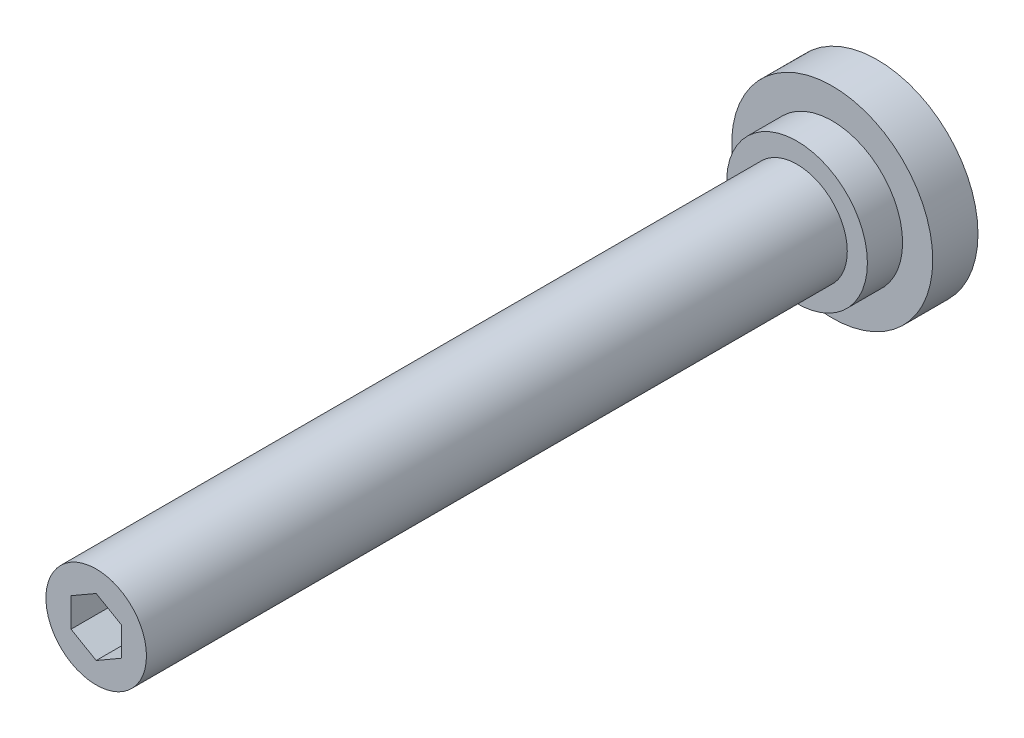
ISO-10303-21;
HEADER;
FILE_DESCRIPTION(('STEP AP214'),'2;1');
FILE_NAME('part.step','',(''),(''),'','','');
FILE_SCHEMA(('AUTOMOTIVE_DESIGN { 1 0 10303 214 1 1 1 1 }'));
ENDSEC;
DATA;
#1=APPLICATION_CONTEXT('core data for automotive mechanical design processes');
#2=APPLICATION_PROTOCOL_DEFINITION('international standard','automotive_design',2000,#1);
#3=PRODUCT_CONTEXT('',#1,'mechanical');
#4=PRODUCT('Part','Part','',(#3));
#5=PRODUCT_RELATED_PRODUCT_CATEGORY('part','',(#4));
#6=PRODUCT_DEFINITION_FORMATION('','',#4);
#7=PRODUCT_DEFINITION_CONTEXT('part definition',#1,'design');
#8=PRODUCT_DEFINITION('design','',#6,#7);
#9=PRODUCT_DEFINITION_SHAPE('','',#8);
#10=(LENGTH_UNIT() NAMED_UNIT(*) SI_UNIT(.MILLI.,.METRE.));
#11=(NAMED_UNIT(*) PLANE_ANGLE_UNIT() SI_UNIT($,.RADIAN.));
#12=(NAMED_UNIT(*) SI_UNIT($,.STERADIAN.) SOLID_ANGLE_UNIT());
#13=UNCERTAINTY_MEASURE_WITH_UNIT(LENGTH_MEASURE(1.E-05),#10,'distance_accuracy_value','');
#14=(GEOMETRIC_REPRESENTATION_CONTEXT(3) GLOBAL_UNCERTAINTY_ASSIGNED_CONTEXT((#13)) GLOBAL_UNIT_ASSIGNED_CONTEXT((#10,
#11,#12)) REPRESENTATION_CONTEXT('',''));
#15=CARTESIAN_POINT('',(0.,0.,0.));
#16=DIRECTION('',(0.,0.,1.));
#17=DIRECTION('',(1.,0.,0.));
#18=AXIS2_PLACEMENT_3D('',#15,#16,#17);
#19=CARTESIAN_POINT('',(0.,0.,155.4));
#20=DIRECTION('',(0.,0.,1.));
#21=DIRECTION('',(1.,0.,0.));
#22=AXIS2_PLACEMENT_3D('',#19,#20,#21);
#23=PLANE('',#22);
#24=DIRECTION('',(-0.866025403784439,0.5,0.));
#25=VECTOR('',#24,1.);
#26=CARTESIAN_POINT('',(5.,2.88675134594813,155.4));
#27=LINE('',#26,#25);
#28=CARTESIAN_POINT('',(5.,2.88675134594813,155.4));
#29=VERTEX_POINT('',#28);
#30=CARTESIAN_POINT('',(0.,5.77350269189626,155.4));
#31=VERTEX_POINT('',#30);
#32=EDGE_CURVE('E28',#29,#31,#27,.T.);
#33=ORIENTED_EDGE('',*,*,#32,.F.);
#34=DIRECTION('',(0.,1.,0.));
#35=VECTOR('',#34,1.);
#36=CARTESIAN_POINT('',(5.,-2.88675134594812,155.4));
#37=LINE('',#36,#35);
#38=CARTESIAN_POINT('',(5.,-2.88675134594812,155.4));
#39=VERTEX_POINT('',#38);
#40=EDGE_CURVE('E111',#39,#29,#37,.T.);
#41=ORIENTED_EDGE('',*,*,#40,.F.);
#42=DIRECTION('',(0.866025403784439,0.5,0.));
#43=VECTOR('',#42,1.);
#44=CARTESIAN_POINT('',(0.,-5.77350269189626,155.4));
#45=LINE('',#44,#43);
#46=CARTESIAN_POINT('',(0.,-5.77350269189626,155.4));
#47=VERTEX_POINT('',#46);
#48=EDGE_CURVE('E109',#47,#39,#45,.T.);
#49=ORIENTED_EDGE('',*,*,#48,.F.);
#50=DIRECTION('',(0.866025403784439,-0.5,0.));
#51=VECTOR('',#50,1.);
#52=CARTESIAN_POINT('',(-5.,-2.88675134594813,155.4));
#53=LINE('',#52,#51);
#54=CARTESIAN_POINT('',(-5.,-2.88675134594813,155.4));
#55=VERTEX_POINT('',#54);
#56=EDGE_CURVE('E76',#55,#47,#53,.T.);
#57=ORIENTED_EDGE('',*,*,#56,.F.);
#58=DIRECTION('',(0.,-1.,0.));
#59=VECTOR('',#58,1.);
#60=CARTESIAN_POINT('',(-5.,2.88675134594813,155.4));
#61=LINE('',#60,#59);
#62=CARTESIAN_POINT('',(-5.,2.88675134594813,155.4));
#63=VERTEX_POINT('',#62);
#64=EDGE_CURVE('E105',#63,#55,#61,.T.);
#65=ORIENTED_EDGE('',*,*,#64,.F.);
#66=DIRECTION('',(-0.866025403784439,-0.5,0.));
#67=VECTOR('',#66,1.);
#68=CARTESIAN_POINT('',(0.,5.77350269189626,155.4));
#69=LINE('',#68,#67);
#70=EDGE_CURVE('E102',#31,#63,#69,.T.);
#71=ORIENTED_EDGE('',*,*,#70,.F.);
#72=EDGE_LOOP('',(#33,#41,#49,#57,#65,#71));
#73=FACE_BOUND('',#72,.T.);
#74=CARTESIAN_POINT('',(0.,0.,155.4));
#75=DIRECTION('',(0.,0.,1.));
#76=DIRECTION('',(1.,0.,0.));
#77=AXIS2_PLACEMENT_3D('',#74,#75,#76);
#78=CIRCLE('',#77,10.);
#79=CARTESIAN_POINT('',(10.,0.,155.4));
#80=VERTEX_POINT('',#79);
#81=EDGE_CURVE('E9',#80,#80,#78,.T.);
#82=ORIENTED_EDGE('',*,*,#81,.T.);
#83=EDGE_LOOP('',(#82));
#84=FACE_BOUND('',#83,.T.);
#85=ADVANCED_FACE('F14',(#73,#84),#23,.T.);
#86=CARTESIAN_POINT('',(0.,0.,30.));
#87=DIRECTION('',(0.,0.,1.));
#88=DIRECTION('',(1.,0.,0.));
#89=AXIS2_PLACEMENT_3D('',#86,#87,#88);
#90=CYLINDRICAL_SURFACE('',#89,10.);
#91=CARTESIAN_POINT('',(0.,0.,16.));
#92=DIRECTION('',(0.,0.,1.));
#93=DIRECTION('',(1.,0.,0.));
#94=AXIS2_PLACEMENT_3D('',#91,#92,#93);
#95=CIRCLE('',#94,10.);
#96=CARTESIAN_POINT('',(10.,0.,16.));
#97=VERTEX_POINT('',#96);
#98=EDGE_CURVE('E21',#97,#97,#95,.T.);
#99=ORIENTED_EDGE('',*,*,#98,.T.);
#100=EDGE_LOOP('',(#99));
#101=FACE_BOUND('',#100,.T.);
#102=ORIENTED_EDGE('',*,*,#81,.F.);
#103=EDGE_LOOP('',(#102));
#104=FACE_BOUND('',#103,.T.);
#105=ADVANCED_FACE('F134',(#101,#104),#90,.T.);
#106=CARTESIAN_POINT('',(-10.,0.,16.));
#107=DIRECTION('',(0.,0.,1.));
#108=DIRECTION('',(1.,0.,0.));
#109=AXIS2_PLACEMENT_3D('',#106,#107,#108);
#110=PLANE('',#109);
#111=CARTESIAN_POINT('',(0.,0.,16.));
#112=DIRECTION('',(0.,0.,1.));
#113=DIRECTION('',(1.,0.,0.));
#114=AXIS2_PLACEMENT_3D('',#111,#112,#113);
#115=CIRCLE('',#114,14.);
#116=CARTESIAN_POINT('',(14.,0.,16.));
#117=VERTEX_POINT('',#116);
#118=EDGE_CURVE('E129',#117,#117,#115,.T.);
#119=ORIENTED_EDGE('',*,*,#118,.T.);
#120=EDGE_LOOP('',(#119));
#121=FACE_BOUND('',#120,.T.);
#122=ORIENTED_EDGE('',*,*,#98,.F.);
#123=EDGE_LOOP('',(#122));
#124=FACE_BOUND('',#123,.T.);
#125=ADVANCED_FACE('F137',(#121,#124),#110,.T.);
#126=CARTESIAN_POINT('',(0.,0.,30.));
#127=DIRECTION('',(0.,0.,1.));
#128=DIRECTION('',(1.,0.,0.));
#129=AXIS2_PLACEMENT_3D('',#126,#127,#128);
#130=CYLINDRICAL_SURFACE('',#129,14.);
#131=CARTESIAN_POINT('',(0.,0.,9.));
#132=DIRECTION('',(0.,0.,1.));
#133=DIRECTION('',(1.,0.,0.));
#134=AXIS2_PLACEMENT_3D('',#131,#132,#133);
#135=CIRCLE('',#134,14.);
#136=CARTESIAN_POINT('',(14.,0.,9.));
#137=VERTEX_POINT('',#136);
#138=EDGE_CURVE('E126',#137,#137,#135,.T.);
#139=ORIENTED_EDGE('',*,*,#138,.T.);
#140=EDGE_LOOP('',(#139));
#141=FACE_BOUND('',#140,.T.);
#142=ORIENTED_EDGE('',*,*,#118,.F.);
#143=EDGE_LOOP('',(#142));
#144=FACE_BOUND('',#143,.T.);
#145=ADVANCED_FACE('F139',(#141,#144),#130,.T.);
#146=CARTESIAN_POINT('',(-14.,0.,9.));
#147=DIRECTION('',(0.,0.,1.));
#148=DIRECTION('',(1.,0.,0.));
#149=AXIS2_PLACEMENT_3D('',#146,#147,#148);
#150=PLANE('',#149);
#151=CARTESIAN_POINT('',(0.,0.,9.));
#152=DIRECTION('',(0.,0.,1.));
#153=DIRECTION('',(1.,0.,0.));
#154=AXIS2_PLACEMENT_3D('',#151,#152,#153);
#155=CIRCLE('',#154,20.);
#156=CARTESIAN_POINT('',(20.,0.,9.));
#157=VERTEX_POINT('',#156);
#158=EDGE_CURVE('E123',#157,#157,#155,.T.);
#159=ORIENTED_EDGE('',*,*,#158,.T.);
#160=EDGE_LOOP('',(#159));
#161=FACE_BOUND('',#160,.T.);
#162=ORIENTED_EDGE('',*,*,#138,.F.);
#163=EDGE_LOOP('',(#162));
#164=FACE_BOUND('',#163,.T.);
#165=ADVANCED_FACE('F147',(#161,#164),#150,.T.);
#166=CARTESIAN_POINT('',(0.,0.,30.));
#167=DIRECTION('',(0.,0.,1.));
#168=DIRECTION('',(1.,0.,0.));
#169=AXIS2_PLACEMENT_3D('',#166,#167,#168);
#170=CYLINDRICAL_SURFACE('',#169,20.);
#171=CARTESIAN_POINT('',(0.,0.,0.));
#172=DIRECTION('',(0.,0.,1.));
#173=DIRECTION('',(1.,0.,0.));
#174=AXIS2_PLACEMENT_3D('',#171,#172,#173);
#175=CIRCLE('',#174,20.);
#176=CARTESIAN_POINT('',(20.,0.,0.));
#177=VERTEX_POINT('',#176);
#178=EDGE_CURVE('E115',#177,#177,#175,.T.);
#179=ORIENTED_EDGE('',*,*,#178,.T.);
#180=EDGE_LOOP('',(#179));
#181=FACE_BOUND('',#180,.T.);
#182=ORIENTED_EDGE('',*,*,#158,.F.);
#183=EDGE_LOOP('',(#182));
#184=FACE_BOUND('',#183,.T.);
#185=ADVANCED_FACE('F172',(#181,#184),#170,.T.);
#186=CARTESIAN_POINT('',(-20.,0.,0.));
#187=DIRECTION('',(0.,0.,-1.));
#188=DIRECTION('',(-1.,0.,0.));
#189=AXIS2_PLACEMENT_3D('',#186,#187,#188);
#190=PLANE('',#189);
#191=ORIENTED_EDGE('',*,*,#178,.F.);
#192=EDGE_LOOP('',(#191));
#193=FACE_BOUND('',#192,.T.);
#194=ADVANCED_FACE('F165',(#193),#190,.T.);
#195=CARTESIAN_POINT('',(5.,2.88675134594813,147.4));
#196=DIRECTION('',(0.5,0.866025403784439,0.));
#197=DIRECTION('',(-0.866025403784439,0.5,0.));
#198=AXIS2_PLACEMENT_3D('',#195,#196,#197);
#199=PLANE('',#198);
#200=ORIENTED_EDGE('',*,*,#32,.T.);
#201=DIRECTION('',(0.,0.,1.));
#202=VECTOR('',#201,1.);
#203=CARTESIAN_POINT('',(0.,5.77350269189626,147.4));
#204=LINE('',#203,#202);
#205=CARTESIAN_POINT('',(0.,5.77350269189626,147.4));
#206=VERTEX_POINT('',#205);
#207=EDGE_CURVE('E58',#206,#31,#204,.T.);
#208=ORIENTED_EDGE('',*,*,#207,.F.);
#209=DIRECTION('',(-0.866025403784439,0.5,0.));
#210=VECTOR('',#209,1.);
#211=CARTESIAN_POINT('',(5.,2.88675134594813,147.4));
#212=LINE('',#211,#210);
#213=CARTESIAN_POINT('',(5.,2.88675134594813,147.4));
#214=VERTEX_POINT('',#213);
#215=EDGE_CURVE('E113',#214,#206,#212,.T.);
#216=ORIENTED_EDGE('',*,*,#215,.F.);
#217=DIRECTION('',(0.,0.,1.));
#218=VECTOR('',#217,1.);
#219=CARTESIAN_POINT('',(5.,2.88675134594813,147.4));
#220=LINE('',#219,#218);
#221=EDGE_CURVE('E36',#214,#29,#220,.T.);
#222=ORIENTED_EDGE('',*,*,#221,.T.);
#223=EDGE_LOOP('',(#200,#208,#216,#222));
#224=FACE_BOUND('',#223,.T.);
#225=ADVANCED_FACE('F162',(#224),#199,.F.);
#226=CARTESIAN_POINT('',(5.,-2.88675134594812,147.4));
#227=DIRECTION('',(1.,0.,0.));
#228=DIRECTION('',(0.,1.,0.));
#229=AXIS2_PLACEMENT_3D('',#226,#227,#228);
#230=PLANE('',#229);
#231=ORIENTED_EDGE('',*,*,#40,.T.);
#232=ORIENTED_EDGE('',*,*,#221,.F.);
#233=DIRECTION('',(0.,1.,0.));
#234=VECTOR('',#233,1.);
#235=CARTESIAN_POINT('',(5.,-2.88675134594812,147.4));
#236=LINE('',#235,#234);
#237=CARTESIAN_POINT('',(5.,-2.88675134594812,147.4));
#238=VERTEX_POINT('',#237);
#239=EDGE_CURVE('E88',#238,#214,#236,.T.);
#240=ORIENTED_EDGE('',*,*,#239,.F.);
#241=DIRECTION('',(0.,0.,1.));
#242=VECTOR('',#241,1.);
#243=CARTESIAN_POINT('',(5.,-2.88675134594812,147.4));
#244=LINE('',#243,#242);
#245=EDGE_CURVE('E80',#238,#39,#244,.T.);
#246=ORIENTED_EDGE('',*,*,#245,.T.);
#247=EDGE_LOOP('',(#231,#232,#240,#246));
#248=FACE_BOUND('',#247,.T.);
#249=ADVANCED_FACE('F164',(#248),#230,.F.);
#250=CARTESIAN_POINT('',(0.,-5.77350269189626,147.4));
#251=DIRECTION('',(0.5,-0.866025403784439,0.));
#252=DIRECTION('',(0.866025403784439,0.5,0.));
#253=AXIS2_PLACEMENT_3D('',#250,#251,#252);
#254=PLANE('',#253);
#255=ORIENTED_EDGE('',*,*,#48,.T.);
#256=ORIENTED_EDGE('',*,*,#245,.F.);
#257=DIRECTION('',(0.866025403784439,0.5,0.));
#258=VECTOR('',#257,1.);
#259=CARTESIAN_POINT('',(0.,-5.77350269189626,147.4));
#260=LINE('',#259,#258);
#261=CARTESIAN_POINT('',(0.,-5.77350269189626,147.4));
#262=VERTEX_POINT('',#261);
#263=EDGE_CURVE('E84',#262,#238,#260,.T.);
#264=ORIENTED_EDGE('',*,*,#263,.F.);
#265=DIRECTION('',(0.,0.,1.));
#266=VECTOR('',#265,1.);
#267=CARTESIAN_POINT('',(0.,-5.77350269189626,147.4));
#268=LINE('',#267,#266);
#269=EDGE_CURVE('E69',#262,#47,#268,.T.);
#270=ORIENTED_EDGE('',*,*,#269,.T.);
#271=EDGE_LOOP('',(#255,#256,#264,#270));
#272=FACE_BOUND('',#271,.T.);
#273=ADVANCED_FACE('F85',(#272),#254,.F.);
#274=CARTESIAN_POINT('',(-5.,-2.88675134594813,147.4));
#275=DIRECTION('',(-0.5,-0.866025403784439,0.));
#276=DIRECTION('',(0.866025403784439,-0.5,0.));
#277=AXIS2_PLACEMENT_3D('',#274,#275,#276);
#278=PLANE('',#277);
#279=ORIENTED_EDGE('',*,*,#56,.T.);
#280=ORIENTED_EDGE('',*,*,#269,.F.);
#281=DIRECTION('',(0.866025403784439,-0.5,0.));
#282=VECTOR('',#281,1.);
#283=CARTESIAN_POINT('',(-5.,-2.88675134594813,147.4));
#284=LINE('',#283,#282);
#285=CARTESIAN_POINT('',(-5.,-2.88675134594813,147.4));
#286=VERTEX_POINT('',#285);
#287=EDGE_CURVE('E73',#286,#262,#284,.T.);
#288=ORIENTED_EDGE('',*,*,#287,.F.);
#289=DIRECTION('',(0.,0.,1.));
#290=VECTOR('',#289,1.);
#291=CARTESIAN_POINT('',(-5.,-2.88675134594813,147.4));
#292=LINE('',#291,#290);
#293=EDGE_CURVE('E81',#286,#55,#292,.T.);
#294=ORIENTED_EDGE('',*,*,#293,.T.);
#295=EDGE_LOOP('',(#279,#280,#288,#294));
#296=FACE_BOUND('',#295,.T.);
#297=ADVANCED_FACE('F71',(#296),#278,.F.);
#298=CARTESIAN_POINT('',(-5.,2.88675134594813,147.4));
#299=DIRECTION('',(-1.,0.,0.));
#300=DIRECTION('',(0.,-1.,0.));
#301=AXIS2_PLACEMENT_3D('',#298,#299,#300);
#302=PLANE('',#301);
#303=ORIENTED_EDGE('',*,*,#64,.T.);
#304=ORIENTED_EDGE('',*,*,#293,.F.);
#305=DIRECTION('',(0.,-1.,0.));
#306=VECTOR('',#305,1.);
#307=CARTESIAN_POINT('',(-5.,2.88675134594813,147.4));
#308=LINE('',#307,#306);
#309=CARTESIAN_POINT('',(-5.,2.88675134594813,147.4));
#310=VERTEX_POINT('',#309);
#311=EDGE_CURVE('E94',#310,#286,#308,.T.);
#312=ORIENTED_EDGE('',*,*,#311,.F.);
#313=DIRECTION('',(0.,0.,1.));
#314=VECTOR('',#313,1.);
#315=CARTESIAN_POINT('',(-5.,2.88675134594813,147.4));
#316=LINE('',#315,#314);
#317=EDGE_CURVE('E118',#310,#63,#316,.T.);
#318=ORIENTED_EDGE('',*,*,#317,.T.);
#319=EDGE_LOOP('',(#303,#304,#312,#318));
#320=FACE_BOUND('',#319,.T.);
#321=ADVANCED_FACE('F237',(#320),#302,.F.);
#322=CARTESIAN_POINT('',(0.,5.77350269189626,147.4));
#323=DIRECTION('',(-0.5,0.866025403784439,0.));
#324=DIRECTION('',(-0.866025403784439,-0.5,0.));
#325=AXIS2_PLACEMENT_3D('',#322,#323,#324);
#326=PLANE('',#325);
#327=ORIENTED_EDGE('',*,*,#70,.T.);
#328=ORIENTED_EDGE('',*,*,#317,.F.);
#329=DIRECTION('',(-0.866025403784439,-0.5,0.));
#330=VECTOR('',#329,1.);
#331=CARTESIAN_POINT('',(0.,5.77350269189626,147.4));
#332=LINE('',#331,#330);
#333=EDGE_CURVE('E96',#206,#310,#332,.T.);
#334=ORIENTED_EDGE('',*,*,#333,.F.);
#335=ORIENTED_EDGE('',*,*,#207,.T.);
#336=EDGE_LOOP('',(#327,#328,#334,#335));
#337=FACE_BOUND('',#336,.T.);
#338=ADVANCED_FACE('F160',(#337),#326,.F.);
#339=CARTESIAN_POINT('',(0.,5.77350269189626,147.4));
#340=DIRECTION('',(0.,0.,1.));
#341=DIRECTION('',(1.,0.,0.));
#342=AXIS2_PLACEMENT_3D('',#339,#340,#341);
#343=PLANE('',#342);
#344=ORIENTED_EDGE('',*,*,#215,.T.);
#345=ORIENTED_EDGE('',*,*,#333,.T.);
#346=ORIENTED_EDGE('',*,*,#311,.T.);
#347=ORIENTED_EDGE('',*,*,#287,.T.);
#348=ORIENTED_EDGE('',*,*,#263,.T.);
#349=ORIENTED_EDGE('',*,*,#239,.T.);
#350=EDGE_LOOP('',(#344,#345,#346,#347,#348,#349));
#351=FACE_BOUND('',#350,.T.);
#352=ADVANCED_FACE('F91',(#351),#343,.T.);
#353=CLOSED_SHELL('',(#85,#105,#125,#145,#165,#185,#194,#225,#249,#273,#297,#321,#338,#352));
#354=MANIFOLD_SOLID_BREP('B1',#353);
#355=ADVANCED_BREP_SHAPE_REPRESENTATION('',(#18,#354),#14);
#356=SHAPE_DEFINITION_REPRESENTATION(#9,#355);
ENDSEC;
END-ISO-10303-21;
